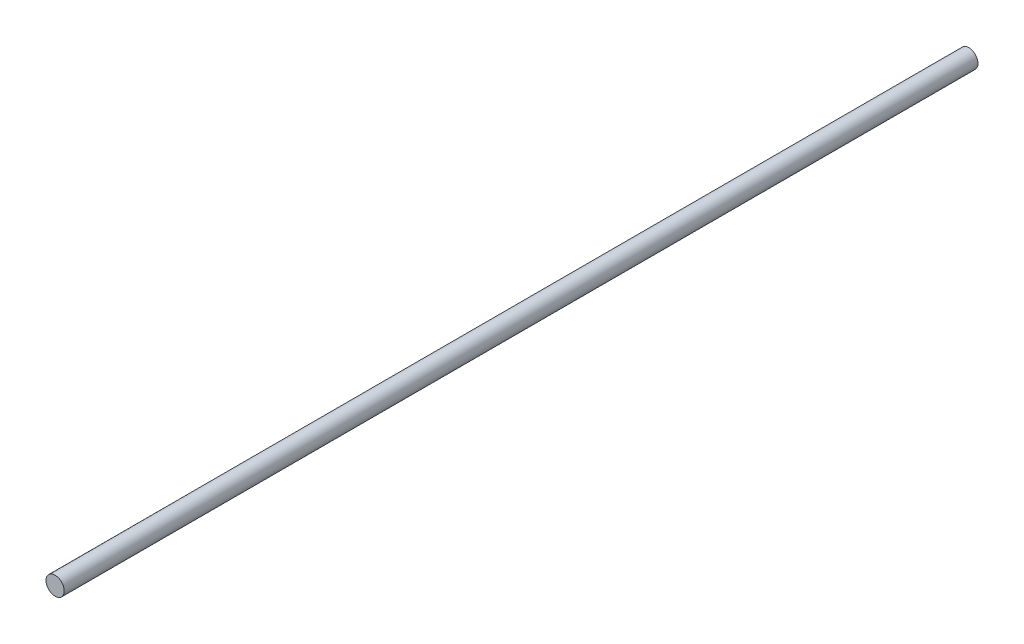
ISO-10303-21;
HEADER;
FILE_DESCRIPTION(('STEP AP214'),'2;1');
FILE_NAME('part.step','',(''),(''),'','','');
FILE_SCHEMA(('AUTOMOTIVE_DESIGN { 1 0 10303 214 1 1 1 1 }'));
ENDSEC;
DATA;
#1=APPLICATION_CONTEXT('core data for automotive mechanical design processes');
#2=APPLICATION_PROTOCOL_DEFINITION('international standard','automotive_design',2000,#1);
#3=PRODUCT_CONTEXT('',#1,'mechanical');
#4=PRODUCT('Part','Part','',(#3));
#5=PRODUCT_RELATED_PRODUCT_CATEGORY('part','',(#4));
#6=PRODUCT_DEFINITION_FORMATION('','',#4);
#7=PRODUCT_DEFINITION_CONTEXT('part definition',#1,'design');
#8=PRODUCT_DEFINITION('design','',#6,#7);
#9=PRODUCT_DEFINITION_SHAPE('','',#8);
#10=(LENGTH_UNIT() NAMED_UNIT(*) SI_UNIT(.MILLI.,.METRE.));
#11=(NAMED_UNIT(*) PLANE_ANGLE_UNIT() SI_UNIT($,.RADIAN.));
#12=(NAMED_UNIT(*) SI_UNIT($,.STERADIAN.) SOLID_ANGLE_UNIT());
#13=UNCERTAINTY_MEASURE_WITH_UNIT(LENGTH_MEASURE(1.E-05),#10,'distance_accuracy_value','');
#14=(GEOMETRIC_REPRESENTATION_CONTEXT(3) GLOBAL_UNCERTAINTY_ASSIGNED_CONTEXT((#13)) GLOBAL_UNIT_ASSIGNED_CONTEXT((#10,
#11,#12)) REPRESENTATION_CONTEXT('',''));
#15=CARTESIAN_POINT('',(0.,0.,0.));
#16=DIRECTION('',(0.,0.,1.));
#17=DIRECTION('',(1.,0.,0.));
#18=AXIS2_PLACEMENT_3D('',#15,#16,#17);
#19=CARTESIAN_POINT('',(0.,0.,600.));
#20=DIRECTION('',(0.,0.,-1.));
#21=DIRECTION('',(-1.,0.,0.));
#22=AXIS2_PLACEMENT_3D('',#19,#20,#21);
#23=CYLINDRICAL_SURFACE('',#22,6.);
#24=CARTESIAN_POINT('',(0.,0.,600.));
#25=DIRECTION('',(0.,0.,1.));
#26=DIRECTION('',(1.,0.,0.));
#27=AXIS2_PLACEMENT_3D('',#24,#25,#26);
#28=CIRCLE('',#27,6.);
#29=CARTESIAN_POINT('',(6.,0.,600.));
#30=VERTEX_POINT('',#29);
#31=EDGE_CURVE('E10',#30,#30,#28,.T.);
#32=ORIENTED_EDGE('',*,*,#31,.F.);
#33=EDGE_LOOP('',(#32));
#34=FACE_BOUND('',#33,.T.);
#35=CARTESIAN_POINT('',(0.,0.,0.));
#36=DIRECTION('',(0.,0.,1.));
#37=DIRECTION('',(1.,0.,0.));
#38=AXIS2_PLACEMENT_3D('',#35,#36,#37);
#39=CIRCLE('',#38,6.);
#40=CARTESIAN_POINT('',(6.,0.,0.));
#41=VERTEX_POINT('',#40);
#42=EDGE_CURVE('E34',#41,#41,#39,.T.);
#43=ORIENTED_EDGE('',*,*,#42,.T.);
#44=EDGE_LOOP('',(#43));
#45=FACE_BOUND('',#44,.T.);
#46=ADVANCED_FACE('F31',(#34,#45),#23,.T.);
#47=CARTESIAN_POINT('',(0.,0.,600.));
#48=DIRECTION('',(0.,0.,1.));
#49=DIRECTION('',(1.,0.,0.));
#50=AXIS2_PLACEMENT_3D('',#47,#48,#49);
#51=PLANE('',#50);
#52=ORIENTED_EDGE('',*,*,#31,.T.);
#53=EDGE_LOOP('',(#52));
#54=FACE_BOUND('',#53,.T.);
#55=ADVANCED_FACE('F46',(#54),#51,.T.);
#56=CARTESIAN_POINT('',(0.,0.,0.));
#57=DIRECTION('',(0.,0.,1.));
#58=DIRECTION('',(1.,0.,0.));
#59=AXIS2_PLACEMENT_3D('',#56,#57,#58);
#60=PLANE('',#59);
#61=ORIENTED_EDGE('',*,*,#42,.F.);
#62=EDGE_LOOP('',(#61));
#63=FACE_BOUND('',#62,.T.);
#64=ADVANCED_FACE('F44',(#63),#60,.F.);
#65=CLOSED_SHELL('',(#46,#55,#64));
#66=MANIFOLD_SOLID_BREP('B2',#65);
#67=ADVANCED_BREP_SHAPE_REPRESENTATION('',(#18,#66),#14);
#68=SHAPE_DEFINITION_REPRESENTATION(#9,#67);
ENDSEC;
END-ISO-10303-21;
